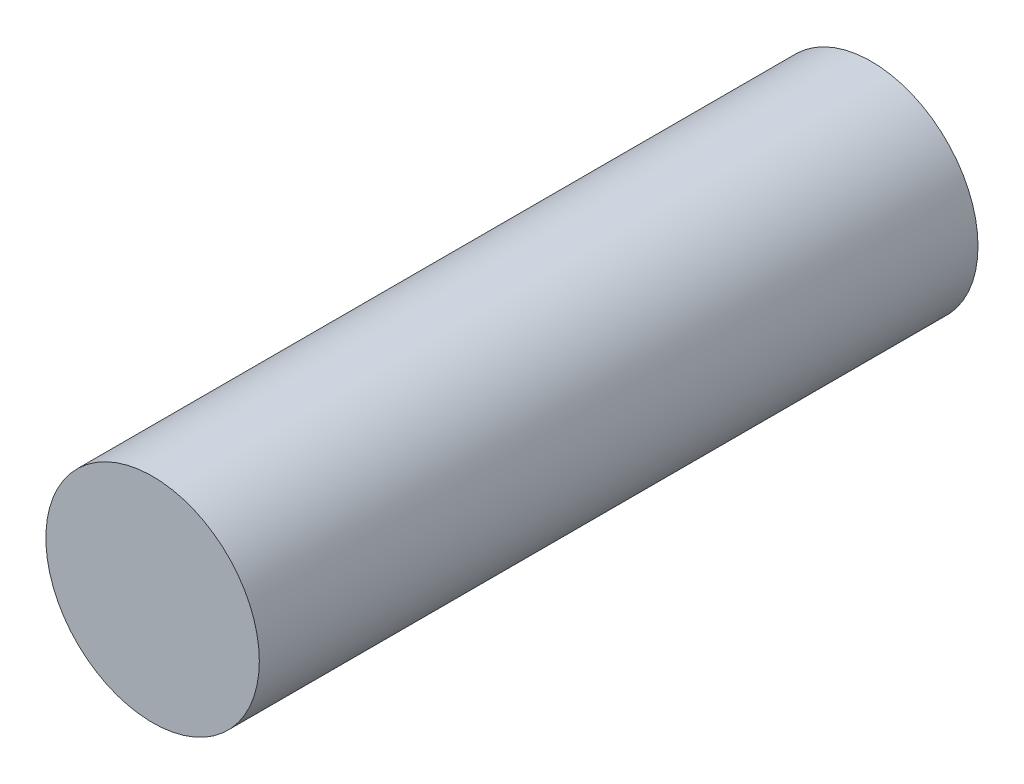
ISO-10303-21;
HEADER;
FILE_DESCRIPTION(('STEP AP214'),'2;1');
FILE_NAME('part.step','',(''),(''),'','','');
FILE_SCHEMA(('AUTOMOTIVE_DESIGN { 1 0 10303 214 1 1 1 1 }'));
ENDSEC;
DATA;
#1=APPLICATION_CONTEXT('core data for automotive mechanical design processes');
#2=APPLICATION_PROTOCOL_DEFINITION('international standard','automotive_design',2000,#1);
#3=PRODUCT_CONTEXT('',#1,'mechanical');
#4=PRODUCT('Part','Part','',(#3));
#5=PRODUCT_RELATED_PRODUCT_CATEGORY('part','',(#4));
#6=PRODUCT_DEFINITION_FORMATION('','',#4);
#7=PRODUCT_DEFINITION_CONTEXT('part definition',#1,'design');
#8=PRODUCT_DEFINITION('design','',#6,#7);
#9=PRODUCT_DEFINITION_SHAPE('','',#8);
#10=(LENGTH_UNIT() NAMED_UNIT(*) SI_UNIT(.MILLI.,.METRE.));
#11=(NAMED_UNIT(*) PLANE_ANGLE_UNIT() SI_UNIT($,.RADIAN.));
#12=(NAMED_UNIT(*) SI_UNIT($,.STERADIAN.) SOLID_ANGLE_UNIT());
#13=UNCERTAINTY_MEASURE_WITH_UNIT(LENGTH_MEASURE(1.E-05),#10,'distance_accuracy_value','');
#14=(GEOMETRIC_REPRESENTATION_CONTEXT(3) GLOBAL_UNCERTAINTY_ASSIGNED_CONTEXT((#13)) GLOBAL_UNIT_ASSIGNED_CONTEXT((#10,
#11,#12)) REPRESENTATION_CONTEXT('',''));
#15=CARTESIAN_POINT('',(0.,0.,0.));
#16=DIRECTION('',(0.,0.,1.));
#17=DIRECTION('',(1.,0.,0.));
#18=AXIS2_PLACEMENT_3D('',#15,#16,#17);
#19=CARTESIAN_POINT('',(0.,0.,1.01000052));
#20=DIRECTION('',(0.,0.,1.));
#21=DIRECTION('',(1.,0.,0.));
#22=AXIS2_PLACEMENT_3D('',#19,#20,#21);
#23=PLANE('',#22);
#24=CARTESIAN_POINT('',(0.,0.,1.01000052));
#25=DIRECTION('',(0.,0.,1.));
#26=DIRECTION('',(1.,0.,0.));
#27=AXIS2_PLACEMENT_3D('',#24,#25,#26);
#28=CIRCLE('',#27,0.1499997);
#29=CARTESIAN_POINT('',(0.1499997,0.,1.01000052));
#30=VERTEX_POINT('',#29);
#31=EDGE_CURVE('E11',#30,#30,#28,.T.);
#32=ORIENTED_EDGE('',*,*,#31,.T.);
#33=EDGE_LOOP('',(#32));
#34=FACE_BOUND('',#33,.T.);
#35=ADVANCED_FACE('F17',(#34),#23,.T.);
#36=CARTESIAN_POINT('',(0.,0.,0.));
#37=DIRECTION('',(0.,0.,1.));
#38=DIRECTION('',(1.,0.,0.));
#39=AXIS2_PLACEMENT_3D('',#36,#37,#38);
#40=PLANE('',#39);
#41=CARTESIAN_POINT('',(0.,0.,0.));
#42=DIRECTION('',(0.,0.,1.));
#43=DIRECTION('',(1.,0.,0.));
#44=AXIS2_PLACEMENT_3D('',#41,#42,#43);
#45=CIRCLE('',#44,0.1499997);
#46=CARTESIAN_POINT('',(0.1499997,0.,0.));
#47=VERTEX_POINT('',#46);
#48=EDGE_CURVE('E42',#47,#47,#45,.T.);
#49=ORIENTED_EDGE('',*,*,#48,.F.);
#50=EDGE_LOOP('',(#49));
#51=FACE_BOUND('',#50,.T.);
#52=ADVANCED_FACE('F64',(#51),#40,.F.);
#53=CARTESIAN_POINT('',(0.,0.,0.));
#54=DIRECTION('',(0.,0.,-1.));
#55=DIRECTION('',(1.,0.,0.));
#56=AXIS2_PLACEMENT_3D('',#53,#54,#55);
#57=CYLINDRICAL_SURFACE('',#56,0.1499997);
#58=ORIENTED_EDGE('',*,*,#48,.T.);
#59=DIRECTION('',(0.,0.,1.));
#60=VECTOR('',#59,1.);
#61=CARTESIAN_POINT('',(0.1499997,0.,0.));
#62=LINE('',#61,#60);
#63=EDGE_CURVE('E25',#47,#30,#62,.T.);
#64=ORIENTED_EDGE('',*,*,#63,.T.);
#65=ORIENTED_EDGE('',*,*,#31,.F.);
#66=ORIENTED_EDGE('',*,*,#63,.F.);
#67=EDGE_LOOP('',(#58,#64,#65,#66));
#68=FACE_BOUND('',#67,.T.);
#69=ADVANCED_FACE('F40',(#68),#57,.T.);
#70=CLOSED_SHELL('',(#35,#52,#69));
#71=MANIFOLD_SOLID_BREP('B1',#70);
#72=ADVANCED_BREP_SHAPE_REPRESENTATION('',(#18,#71),#14);
#73=SHAPE_DEFINITION_REPRESENTATION(#9,#72);
ENDSEC;
END-ISO-10303-21;
